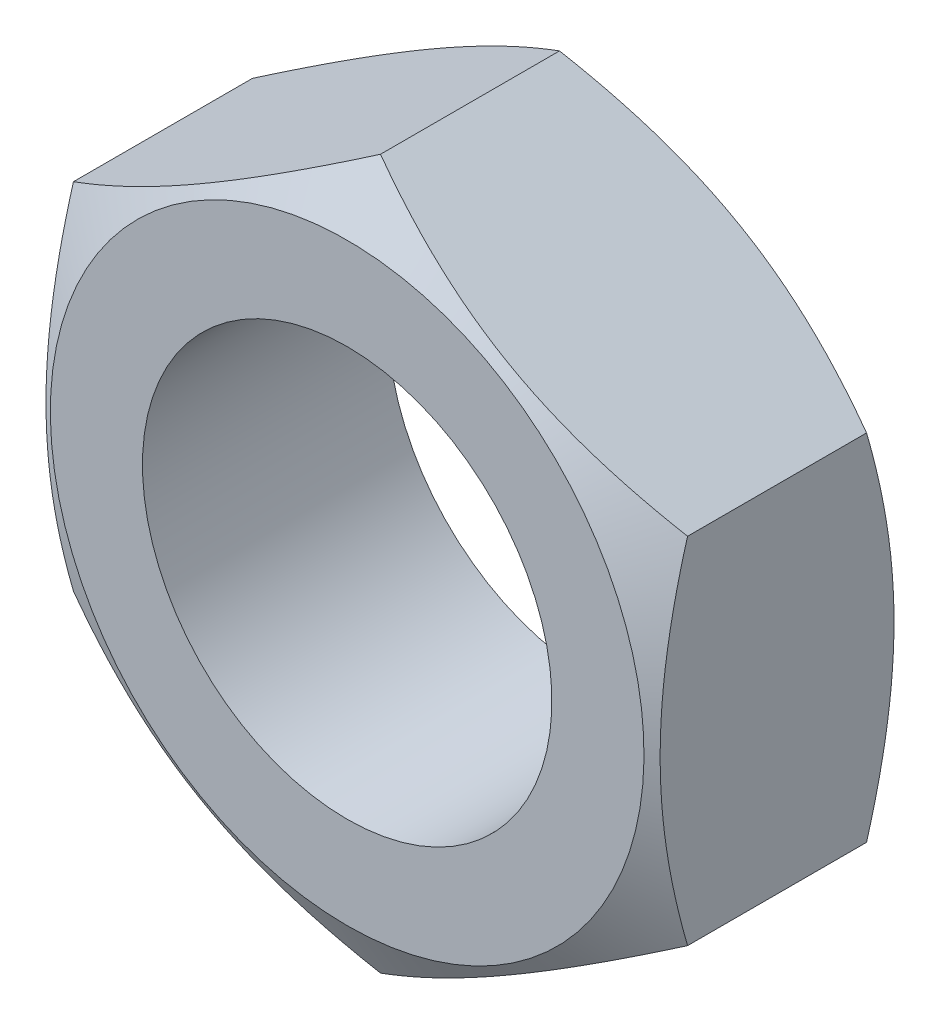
ISO-10303-21;
HEADER;
FILE_DESCRIPTION(('STEP AP214'),'2;1');
FILE_NAME('part.step','',(''),(''),'','','');
FILE_SCHEMA(('AUTOMOTIVE_DESIGN { 1 0 10303 214 1 1 1 1 }'));
ENDSEC;
DATA;
#1=APPLICATION_CONTEXT('core data for automotive mechanical design processes');
#2=APPLICATION_PROTOCOL_DEFINITION('international standard','automotive_design',2000,#1);
#3=PRODUCT_CONTEXT('',#1,'mechanical');
#4=PRODUCT('Part','Part','',(#3));
#5=PRODUCT_RELATED_PRODUCT_CATEGORY('part','',(#4));
#6=PRODUCT_DEFINITION_FORMATION('','',#4);
#7=PRODUCT_DEFINITION_CONTEXT('part definition',#1,'design');
#8=PRODUCT_DEFINITION('design','',#6,#7);
#9=PRODUCT_DEFINITION_SHAPE('','',#8);
#10=(LENGTH_UNIT() NAMED_UNIT(*) SI_UNIT(.MILLI.,.METRE.));
#11=(NAMED_UNIT(*) PLANE_ANGLE_UNIT() SI_UNIT($,.RADIAN.));
#12=(NAMED_UNIT(*) SI_UNIT($,.STERADIAN.) SOLID_ANGLE_UNIT());
#13=UNCERTAINTY_MEASURE_WITH_UNIT(LENGTH_MEASURE(1.E-05),#10,'distance_accuracy_value','');
#14=(GEOMETRIC_REPRESENTATION_CONTEXT(3) GLOBAL_UNCERTAINTY_ASSIGNED_CONTEXT((#13)) GLOBAL_UNIT_ASSIGNED_CONTEXT((#10,
#11,#12)) REPRESENTATION_CONTEXT('',''));
#15=CARTESIAN_POINT('',(0.,0.,0.));
#16=DIRECTION('',(0.,0.,1.));
#17=DIRECTION('',(1.,0.,0.));
#18=AXIS2_PLACEMENT_3D('',#15,#16,#17);
#19=CARTESIAN_POINT('',(-15.,-8.66025403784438,18.));
#20=DIRECTION('',(-1.,0.,0.));
#21=DIRECTION('',(0.,0.,1.));
#22=AXIS2_PLACEMENT_3D('',#19,#20,#21);
#23=PLANE('',#22);
#24=CARTESIAN_POINT('',(-15.,-23.4699725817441,4.2901236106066));
#25=CARTESIAN_POINT('',(-15.,-23.1415247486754,4.44990417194));
#26=CARTESIAN_POINT('',(-15.,-22.8126970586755,4.6089035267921));
#27=CARTESIAN_POINT('',(-15.,-22.1542027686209,4.92516329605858));
#28=CARTESIAN_POINT('',(-15.,-21.8245361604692,5.08242369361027));
#29=CARTESIAN_POINT('',(-15.,-20.8340741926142,5.55137178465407));
#30=CARTESIAN_POINT('',(-15.,-20.1719106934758,5.86018052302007));
#31=CARTESIAN_POINT('',(-15.,-18.8397161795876,6.46991088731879));
#32=CARTESIAN_POINT('',(-15.,-18.1696620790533,6.77078219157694));
#33=CARTESIAN_POINT('',(-15.,-16.8242973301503,7.36049108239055));
#34=CARTESIAN_POINT('',(-15.,-16.1489869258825,7.64932922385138));
#35=CARTESIAN_POINT('',(-15.,-14.7694563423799,8.22115365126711));
#36=CARTESIAN_POINT('',(-15.,-14.0650218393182,8.50362552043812));
#37=CARTESIAN_POINT('',(-15.,-12.6479834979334,9.04768994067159));
#38=CARTESIAN_POINT('',(-15.,-11.9353787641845,9.30928017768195));
#39=CARTESIAN_POINT('',(-15.,-10.5021570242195,9.80486153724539));
#40=CARTESIAN_POINT('',(-15.,-9.78155888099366,10.0389067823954));
#41=CARTESIAN_POINT('',(-15.,-8.3299601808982,10.4720397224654));
#42=CARTESIAN_POINT('',(-15.,-7.59896291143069,10.6711382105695));
#43=CARTESIAN_POINT('',(-15.,-6.49655522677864,10.9359278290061));
#44=CARTESIAN_POINT('',(-15.,-6.12914358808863,11.0183630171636));
#45=CARTESIAN_POINT('',(-15.,-5.39177201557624,11.170985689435));
#46=CARTESIAN_POINT('',(-15.,-5.02181213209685,11.2411734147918));
#47=CARTESIAN_POINT('',(-15.,-4.27958352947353,11.3680754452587));
#48=CARTESIAN_POINT('',(-15.,-3.90731484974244,11.4247899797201));
#49=CARTESIAN_POINT('',(-15.,-3.16084805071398,11.5236220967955));
#50=CARTESIAN_POINT('',(-15.,-2.78665001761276,11.5657403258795));
#51=CARTESIAN_POINT('',(-15.,-2.04182159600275,11.6340035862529));
#52=CARTESIAN_POINT('',(-15.,-1.6712101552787,11.6603540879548));
#53=CARTESIAN_POINT('',(-15.,-0.929205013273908,11.697348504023));
#54=CARTESIAN_POINT('',(-15.,-0.557811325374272,11.7079926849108));
#55=CARTESIAN_POINT('',(-15.,0.185094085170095,11.7133203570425));
#56=CARTESIAN_POINT('',(-15.,0.556605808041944,11.7080038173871));
#57=CARTESIAN_POINT('',(-15.,1.29906958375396,11.6815421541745));
#58=CARTESIAN_POINT('',(-15.,1.6700216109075,11.6603963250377));
#59=CARTESIAN_POINT('',(-15.,2.55529607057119,11.5914975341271));
#60=CARTESIAN_POINT('',(-15.,3.06907123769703,11.5365813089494));
#61=CARTESIAN_POINT('',(-15.,4.09294738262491,11.3993260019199));
#62=CARTESIAN_POINT('',(-15.,4.60304787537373,11.3169833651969));
#63=CARTESIAN_POINT('',(-15.,5.61903977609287,11.127804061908));
#64=CARTESIAN_POINT('',(-15.,6.1249277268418,11.0209490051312));
#65=CARTESIAN_POINT('',(-15.,7.13169797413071,10.7860166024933));
#66=CARTESIAN_POINT('',(-15.,7.63258033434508,10.6579395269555));
#67=CARTESIAN_POINT('',(-15.,8.64055583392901,10.3806091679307));
#68=CARTESIAN_POINT('',(-15.,9.1475348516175,10.2309439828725));
#69=CARTESIAN_POINT('',(-15.,10.1565015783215,9.91572688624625));
#70=CARTESIAN_POINT('',(-15.,10.6584892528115,9.75017486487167));
#71=CARTESIAN_POINT('',(-15.,11.6577149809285,9.40584964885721));
#72=CARTESIAN_POINT('',(-15.,12.1549544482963,9.22708053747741));
#73=CARTESIAN_POINT('',(-15.,13.1452841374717,8.85846579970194));
#74=CARTESIAN_POINT('',(-15.,13.6383744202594,8.66862033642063));
#75=CARTESIAN_POINT('',(-15.,14.8483575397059,8.18963171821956));
#76=CARTESIAN_POINT('',(-15.,15.56315957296,7.89521338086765));
#77=CARTESIAN_POINT('',(-15.,16.9862746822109,7.29104274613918));
#78=CARTESIAN_POINT('',(-15.,17.6945872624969,6.98128928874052));
#79=CARTESIAN_POINT('',(-15.,19.1060111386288,6.34968118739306));
#80=CARTESIAN_POINT('',(-15.,19.8091209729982,6.02782328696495));
#81=CARTESIAN_POINT('',(-15.,21.2108662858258,5.37458154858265));
#82=CARTESIAN_POINT('',(-15.,21.9095018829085,5.04319796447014));
#83=CARTESIAN_POINT('',(-15.,23.3039583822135,4.37235226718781));
#84=CARTESIAN_POINT('',(-15.,23.9997746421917,4.03288052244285));
#85=CARTESIAN_POINT('',(-15.,25.3883291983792,3.34769944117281));
#86=CARTESIAN_POINT('',(-15.,26.081067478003,3.00199007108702));
#87=CARTESIAN_POINT('',(-15.,27.4638560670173,2.30550379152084));
#88=CARTESIAN_POINT('',(-15.,28.1539067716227,1.95472766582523));
#89=CARTESIAN_POINT('',(-15.,29.5318258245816,1.24892319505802));
#90=CARTESIAN_POINT('',(-15.,30.2196941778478,0.893894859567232));
#91=CARTESIAN_POINT('',(-15.,32.1564022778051,-0.112035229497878));
#92=CARTESIAN_POINT('',(-15.,33.4031142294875,-0.767033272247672));
#93=CARTESIAN_POINT('',(-15.,35.8919889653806,-2.0857235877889));
#94=CARTESIAN_POINT('',(-15.,37.1341515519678,-2.74941623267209));
#95=CARTESIAN_POINT('',(-15.,39.6114638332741,-4.0815417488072));
#96=CARTESIAN_POINT('',(-15.,40.8466234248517,-4.74995622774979));
#97=CARTESIAN_POINT('',(-15.,42.6972399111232,-5.75638590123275));
#98=CARTESIAN_POINT('',(-15.,43.3137394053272,-6.09248676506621));
#99=CARTESIAN_POINT('',(-15.,44.5461141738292,-6.76582888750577));
#100=CARTESIAN_POINT('',(-15.,45.1619894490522,-7.10307014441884));
#101=CARTESIAN_POINT('',(-15.,45.777588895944,-7.44081428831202));
#102=B_SPLINE_CURVE_WITH_KNOTS('',3,(#24,#25,#26,#27,#28,#29,#30,#31,#32,#33,#34,#35,#36,#37,
#38,#39,#40,#41,#42,#43,#44,#45,#46,#47,#48,#49,#50,#51,#52,#53,#54,#55,#56,#57,#58,#59,#60,#61,
#62,#63,#64,#65,#66,#67,#68,#69,#70,#71,#72,#73,#74,#75,#76,#77,#78,#79,#80,#81,#82,#83,#84,#85,
#86,#87,#88,#89,#90,#91,#92,#93,#94,#95,#96,#97,#98,#99,#100,#101),.UNSPECIFIED.,.F.,.F.,(4,2,2,
2,2,2,2,2,2,2,2,2,2,2,2,2,2,2,2,2,2,2,2,2,2,2,2,2,2,2,2,2,2,2,2,2,2,2,4),(0.,1.09574908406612,
2.19150878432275,4.38334194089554,6.58676146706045,8.79007927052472,11.0667025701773,
13.3435778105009,15.615901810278,17.887522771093,19.0169896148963,20.1464342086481,
21.2758595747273,22.4052349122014,23.5195532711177,24.6338527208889,25.7481543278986,
26.8625056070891,28.4117584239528,29.961212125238,31.5118321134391,33.0624323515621,
34.6479488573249,36.233476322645,37.8185159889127,39.4035323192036,41.7224664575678,
44.041576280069,46.3613145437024,48.680991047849,51.0035835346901,53.3261885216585,
55.6484379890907,57.9706822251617,62.1955342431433,66.4205676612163,70.6338128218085,
72.7403063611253,74.8467967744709),.UNSPECIFIED.);
#103=CARTESIAN_POINT('',(-15.,8.66025403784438,10.3715789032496));
#104=VERTEX_POINT('',#103);
#105=CARTESIAN_POINT('',(-15.,-8.66025403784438,10.3715789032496));
#106=VERTEX_POINT('',#105);
#107=EDGE_CURVE('E74',#104,#106,#102,.F.);
#108=ORIENTED_EDGE('',*,*,#107,.F.);
#109=DIRECTION('',(0.,0.,-1.));
#110=VECTOR('',#109,1.);
#111=CARTESIAN_POINT('',(-15.,8.66025403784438,18.));
#112=LINE('',#111,#110);
#113=CARTESIAN_POINT('',(-15.,8.66025403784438,1.62842109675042));
#114=VERTEX_POINT('',#113);
#115=EDGE_CURVE('E43',#104,#114,#112,.T.);
#116=ORIENTED_EDGE('',*,*,#115,.T.);
#117=CARTESIAN_POINT('',(-15.,-23.4699725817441,7.70987638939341));
#118=CARTESIAN_POINT('',(-15.,-23.1415247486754,7.55009582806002));
#119=CARTESIAN_POINT('',(-15.,-22.8126970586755,7.39109647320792));
#120=CARTESIAN_POINT('',(-15.,-22.1542027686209,7.07483670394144));
#121=CARTESIAN_POINT('',(-15.,-21.8245361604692,6.91757630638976));
#122=CARTESIAN_POINT('',(-15.,-20.8340741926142,6.44862821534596));
#123=CARTESIAN_POINT('',(-15.,-20.1719106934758,6.13981947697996));
#124=CARTESIAN_POINT('',(-15.,-18.8397161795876,5.53008911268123));
#125=CARTESIAN_POINT('',(-15.,-18.1696620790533,5.22921780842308));
#126=CARTESIAN_POINT('',(-15.,-16.8242973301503,4.63950891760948));
#127=CARTESIAN_POINT('',(-15.,-16.1489869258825,4.35067077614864));
#128=CARTESIAN_POINT('',(-15.,-14.7694563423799,3.77884634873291));
#129=CARTESIAN_POINT('',(-15.,-14.0650218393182,3.49637447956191));
#130=CARTESIAN_POINT('',(-15.,-12.6479834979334,2.95231005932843));
#131=CARTESIAN_POINT('',(-15.,-11.9353787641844,2.69071982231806));
#132=CARTESIAN_POINT('',(-15.,-10.5021570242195,2.19513846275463));
#133=CARTESIAN_POINT('',(-15.,-9.78155888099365,1.96109321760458));
#134=CARTESIAN_POINT('',(-15.,-8.32996018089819,1.52796027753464));
#135=CARTESIAN_POINT('',(-15.,-7.59896291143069,1.32886178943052));
#136=CARTESIAN_POINT('',(-15.,-6.49655522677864,1.06407217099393));
#137=CARTESIAN_POINT('',(-15.,-6.12914358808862,0.981636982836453));
#138=CARTESIAN_POINT('',(-15.,-5.39177201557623,0.829014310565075));
#139=CARTESIAN_POINT('',(-15.,-5.02181213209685,0.758826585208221));
#140=CARTESIAN_POINT('',(-15.,-4.27958352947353,0.631924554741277));
#141=CARTESIAN_POINT('',(-15.,-3.90731484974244,0.575210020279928));
#142=CARTESIAN_POINT('',(-15.,-3.16084805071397,0.4763779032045));
#143=CARTESIAN_POINT('',(-15.,-2.78665001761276,0.434259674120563));
#144=CARTESIAN_POINT('',(-15.,-2.04182159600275,0.365996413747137));
#145=CARTESIAN_POINT('',(-15.,-1.6712101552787,0.339645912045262));
#146=CARTESIAN_POINT('',(-15.,-0.929205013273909,0.302651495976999));
#147=CARTESIAN_POINT('',(-15.,-0.557811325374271,0.292007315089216));
#148=CARTESIAN_POINT('',(-15.,0.185094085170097,0.286679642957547));
#149=CARTESIAN_POINT('',(-15.,0.556605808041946,0.291996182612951));
#150=CARTESIAN_POINT('',(-15.,1.29906958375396,0.318457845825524));
#151=CARTESIAN_POINT('',(-15.,1.6700216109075,0.339603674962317));
#152=CARTESIAN_POINT('',(-15.,2.55529607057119,0.408502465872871));
#153=CARTESIAN_POINT('',(-15.,3.06907123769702,0.463418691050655));
#154=CARTESIAN_POINT('',(-15.,4.0929473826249,0.60067399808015));
#155=CARTESIAN_POINT('',(-15.,4.60304787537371,0.683016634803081));
#156=CARTESIAN_POINT('',(-15.,5.61903977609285,0.872195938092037));
#157=CARTESIAN_POINT('',(-15.,6.12492772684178,0.979050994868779));
#158=CARTESIAN_POINT('',(-15.,7.13169797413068,1.21398339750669));
#159=CARTESIAN_POINT('',(-15.,7.63258033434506,1.34206047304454));
#160=CARTESIAN_POINT('',(-15.,8.64055583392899,1.6193908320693));
#161=CARTESIAN_POINT('',(-15.,9.14753485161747,1.76905601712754));
#162=CARTESIAN_POINT('',(-15.,10.1565015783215,2.08427311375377));
#163=CARTESIAN_POINT('',(-15.,10.6584892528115,2.24982513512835));
#164=CARTESIAN_POINT('',(-15.,11.6577149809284,2.5941503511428));
#165=CARTESIAN_POINT('',(-15.,12.1549544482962,2.77291946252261));
#166=CARTESIAN_POINT('',(-15.,13.1452841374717,3.14153420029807));
#167=CARTESIAN_POINT('',(-15.,13.6383744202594,3.33137966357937));
#168=CARTESIAN_POINT('',(-15.,14.8483575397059,3.81036828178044));
#169=CARTESIAN_POINT('',(-15.,15.56315957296,4.10478661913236));
#170=CARTESIAN_POINT('',(-15.,16.9862746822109,4.70895725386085));
#171=CARTESIAN_POINT('',(-15.,17.6945872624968,5.0187107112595));
#172=CARTESIAN_POINT('',(-15.,19.1060111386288,5.65031881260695));
#173=CARTESIAN_POINT('',(-15.,19.8091209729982,5.97217671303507));
#174=CARTESIAN_POINT('',(-15.,21.2108662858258,6.62541845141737));
#175=CARTESIAN_POINT('',(-15.,21.9095018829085,6.95680203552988));
#176=CARTESIAN_POINT('',(-15.,23.3039583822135,7.62764773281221));
#177=CARTESIAN_POINT('',(-15.,23.9997746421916,7.96711947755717));
#178=CARTESIAN_POINT('',(-15.,25.3883291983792,8.65230055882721));
#179=CARTESIAN_POINT('',(-15.,26.081067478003,8.998009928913));
#180=CARTESIAN_POINT('',(-15.,27.4638560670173,9.69449620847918));
#181=CARTESIAN_POINT('',(-15.,28.1539067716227,10.0452723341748));
#182=CARTESIAN_POINT('',(-15.,29.5318258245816,10.751076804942));
#183=CARTESIAN_POINT('',(-15.,30.2196941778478,11.1061051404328));
#184=CARTESIAN_POINT('',(-15.,32.1564022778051,12.1120352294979));
#185=CARTESIAN_POINT('',(-15.,33.4031142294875,12.7670332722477));
#186=CARTESIAN_POINT('',(-15.,35.8919889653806,14.0857235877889));
#187=CARTESIAN_POINT('',(-15.,37.1341515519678,14.7494162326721));
#188=CARTESIAN_POINT('',(-15.,39.6114638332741,16.0815417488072));
#189=CARTESIAN_POINT('',(-15.,40.8466234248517,16.7499562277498));
#190=CARTESIAN_POINT('',(-15.,42.6972399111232,17.7563859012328));
#191=CARTESIAN_POINT('',(-15.,43.3137394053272,18.0924867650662));
#192=CARTESIAN_POINT('',(-15.,44.5461141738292,18.7658288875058));
#193=CARTESIAN_POINT('',(-15.,45.1619894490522,19.1030701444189));
#194=CARTESIAN_POINT('',(-15.,45.777588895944,19.440814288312));
#195=B_SPLINE_CURVE_WITH_KNOTS('',3,(#117,#118,#119,#120,#121,#122,#123,#124,#125,#126,#127,
#128,#129,#130,#131,#132,#133,#134,#135,#136,#137,#138,#139,#140,#141,#142,#143,#144,#145,#146,
#147,#148,#149,#150,#151,#152,#153,#154,#155,#156,#157,#158,#159,#160,#161,#162,#163,#164,#165,
#166,#167,#168,#169,#170,#171,#172,#173,#174,#175,#176,#177,#178,#179,#180,#181,#182,#183,#184,
#185,#186,#187,#188,#189,#190,#191,#192,#193,#194),.UNSPECIFIED.,.F.,.F.,(4,2,2,2,2,2,2,2,2,2,2,
2,2,2,2,2,2,2,2,2,2,2,2,2,2,2,2,2,2,2,2,2,2,2,2,2,2,2,4),(0.,1.09574908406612,2.19150878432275,
4.38334194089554,6.58676146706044,8.79007927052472,11.0667025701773,13.3435778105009,
15.6159018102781,17.887522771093,19.0169896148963,20.1464342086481,21.2758595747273,
22.4052349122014,23.5195532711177,24.6338527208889,25.7481543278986,26.8625056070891,
28.4117584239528,29.961212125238,31.5118321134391,33.0624323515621,34.6479488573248,
36.233476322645,37.8185159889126,39.4035323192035,41.7224664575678,44.041576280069,
46.3613145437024,48.6809910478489,51.0035835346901,53.3261885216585,55.6484379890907,
57.9706822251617,62.1955342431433,66.4205676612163,70.6338128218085,72.7403063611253,
74.8467967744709),.UNSPECIFIED.);
#196=CARTESIAN_POINT('',(-15.,-8.66025403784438,1.62842109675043));
#197=VERTEX_POINT('',#196);
#198=EDGE_CURVE('E92',#197,#114,#195,.T.);
#199=ORIENTED_EDGE('',*,*,#198,.F.);
#200=DIRECTION('',(0.,0.,-1.));
#201=VECTOR('',#200,1.);
#202=CARTESIAN_POINT('',(-15.,-8.66025403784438,18.));
#203=LINE('',#202,#201);
#204=EDGE_CURVE('E29',#106,#197,#203,.T.);
#205=ORIENTED_EDGE('',*,*,#204,.F.);
#206=EDGE_LOOP('',(#108,#116,#199,#205));
#207=FACE_BOUND('',#206,.T.);
#208=ADVANCED_FACE('F14',(#207),#23,.T.);
#209=CARTESIAN_POINT('',(-15.,-8.66025403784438,18.));
#210=DIRECTION('',(0.5,0.86602540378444,0.));
#211=DIRECTION('',(-0.86602540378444,0.5,0.));
#212=AXIS2_PLACEMENT_3D('',#209,#210,#211);
#213=PLANE('',#212);
#214=DIRECTION('',(0.,0.,-1.));
#215=VECTOR('',#214,1.);
#216=CARTESIAN_POINT('',(0.,-17.3205080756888,18.));
#217=LINE('',#216,#215);
#218=CARTESIAN_POINT('',(0.,-17.3205080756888,10.3715789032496));
#219=VERTEX_POINT('',#218);
#220=CARTESIAN_POINT('',(0.,-17.3205080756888,1.62842109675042));
#221=VERTEX_POINT('',#220);
#222=EDGE_CURVE('E99',#219,#221,#217,.T.);
#223=ORIENTED_EDGE('',*,*,#222,.F.);
#224=CARTESIAN_POINT('',(0.000200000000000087,-17.3206235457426,10.3715122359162));
#225=CARTESIAN_POINT('',(-0.329494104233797,-17.130274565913,10.4814030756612));
#226=CARTESIAN_POINT('',(-0.660474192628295,-16.939183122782,10.5863072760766));
#227=CARTESIAN_POINT('',(-1.32508844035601,-16.5554679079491,10.7847562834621));
#228=CARTESIAN_POINT('',(-1.6587234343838,-16.3628436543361,10.8782973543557));
#229=CARTESIAN_POINT('',(-2.32929228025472,-15.9756905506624,11.0527627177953));
#230=CARTESIAN_POINT('',(-2.66623200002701,-15.7811583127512,11.133657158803));
#231=CARTESIAN_POINT('',(-3.34245276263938,-15.3907420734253,11.2810922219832));
#232=CARTESIAN_POINT('',(-3.68173367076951,-15.1948581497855,11.3476336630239));
#233=CARTESIAN_POINT('',(-4.35394314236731,-14.8067578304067,11.4635324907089));
#234=CARTESIAN_POINT('',(-4.68682180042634,-14.6145702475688,11.5132734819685));
#235=CARTESIAN_POINT('',(-5.3541044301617,-14.2293144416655,11.5966781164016));
#236=CARTESIAN_POINT('',(-5.68850843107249,-14.0362462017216,11.6303414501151));
#237=CARTESIAN_POINT('',(-6.35787818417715,-13.6497853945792,11.6807407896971));
#238=CARTESIAN_POINT('',(-6.69284279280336,-13.4563934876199,11.6974969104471));
#239=CARTESIAN_POINT('',(-7.36308121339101,-13.0694311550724,11.7137214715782));
#240=CARTESIAN_POINT('',(-7.69835501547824,-12.8758607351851,11.7131904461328));
#241=CARTESIAN_POINT('',(-8.3251468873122,-12.5139822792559,11.696048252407));
#242=CARTESIAN_POINT('',(-8.61670962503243,-12.3456484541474,11.6815280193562));
#243=CARTESIAN_POINT('',(-9.19916443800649,-12.0093680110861,11.6396877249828));
#244=CARTESIAN_POINT('',(-9.49005646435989,-11.8414214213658,11.6123667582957));
#245=CARTESIAN_POINT('',(-10.0710118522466,-11.5060066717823,11.5454013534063));
#246=CARTESIAN_POINT('',(-10.3610743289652,-11.338539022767,11.5057467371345));
#247=CARTESIAN_POINT('',(-10.939839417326,-11.0043888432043,11.4148097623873));
#248=CARTESIAN_POINT('',(-11.2285419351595,-10.8377063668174,11.3635266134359));
#249=CARTESIAN_POINT('',(-12.1049144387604,-10.3317324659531,11.1909380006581));
#250=CARTESIAN_POINT('',(-12.6900465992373,-9.99390625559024,11.0524236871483));
#251=CARTESIAN_POINT('',(-13.8515859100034,-9.32329122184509,10.73805289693));
#252=CARTESIAN_POINT('',(-14.4280079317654,-8.99049381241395,10.5622702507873));
#253=CARTESIAN_POINT('',(-15.0002,-8.66013856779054,10.3715122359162));
#254=B_SPLINE_CURVE_WITH_KNOTS('',3,(#224,#225,#226,#227,#228,#229,#230,#231,#232,#233,#234,
#235,#236,#237,#238,#239,#240,#241,#242,#243,#244,#245,#246,#247,#248,#249,#250,#251,#252,#253),
.UNSPECIFIED.,.F.,.F.,(4,2,2,2,2,2,2,2,2,2,2,2,2,2,4),(0.,1.18875411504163,2.37789802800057,
3.56980778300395,4.76164951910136,5.92407379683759,7.08652044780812,8.24758247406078,
9.40860862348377,10.4193068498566,11.4300765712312,12.4416826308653,13.4533574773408,
15.5211962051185,17.5849760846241),.UNSPECIFIED.);
#255=EDGE_CURVE('E80',#219,#106,#254,.T.);
#256=ORIENTED_EDGE('',*,*,#255,.T.);
#257=ORIENTED_EDGE('',*,*,#204,.T.);
#258=CARTESIAN_POINT('',(-15.0002,-8.66013856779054,1.62848776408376));
#259=CARTESIAN_POINT('',(-14.6705058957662,-8.85048754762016,1.51859692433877));
#260=CARTESIAN_POINT('',(-14.3395258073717,-9.04157899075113,1.41369272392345));
#261=CARTESIAN_POINT('',(-13.674911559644,-9.42529420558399,1.21524371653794));
#262=CARTESIAN_POINT('',(-13.3412765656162,-9.61791845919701,1.12170264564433));
#263=CARTESIAN_POINT('',(-12.6707077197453,-10.0050715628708,0.947237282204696));
#264=CARTESIAN_POINT('',(-12.333767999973,-10.199603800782,0.866342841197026));
#265=CARTESIAN_POINT('',(-11.6575472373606,-10.5900200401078,0.718907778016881));
#266=CARTESIAN_POINT('',(-11.3182663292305,-10.7859039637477,0.652366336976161));
#267=CARTESIAN_POINT('',(-10.6460568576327,-11.1740042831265,0.536467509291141));
#268=CARTESIAN_POINT('',(-10.3131781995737,-11.3661918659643,0.4867265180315));
#269=CARTESIAN_POINT('',(-9.6458955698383,-11.7514476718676,0.403321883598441));
#270=CARTESIAN_POINT('',(-9.3114915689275,-11.9445159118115,0.369658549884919));
#271=CARTESIAN_POINT('',(-8.64212181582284,-12.3309767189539,0.319259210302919));
#272=CARTESIAN_POINT('',(-8.30715720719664,-12.5243686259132,0.302503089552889));
#273=CARTESIAN_POINT('',(-7.63691878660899,-12.9113309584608,0.286278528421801));
#274=CARTESIAN_POINT('',(-7.30164498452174,-13.104901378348,0.286809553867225));
#275=CARTESIAN_POINT('',(-6.67485311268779,-13.4667798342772,0.303951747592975));
#276=CARTESIAN_POINT('',(-6.38329037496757,-13.6351136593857,0.318471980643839));
#277=CARTESIAN_POINT('',(-5.80083556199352,-13.971394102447,0.360312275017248));
#278=CARTESIAN_POINT('',(-5.50994353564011,-14.1393406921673,0.387633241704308));
#279=CARTESIAN_POINT('',(-4.92898814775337,-14.4747554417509,0.454598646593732));
#280=CARTESIAN_POINT('',(-4.63892567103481,-14.6422230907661,0.49425326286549));
#281=CARTESIAN_POINT('',(-4.06016058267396,-14.9763732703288,0.585190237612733));
#282=CARTESIAN_POINT('',(-3.77145806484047,-15.1430557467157,0.636473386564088));
#283=CARTESIAN_POINT('',(-2.89508556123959,-15.6490296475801,0.809061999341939));
#284=CARTESIAN_POINT('',(-2.30995340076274,-15.9868558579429,0.947576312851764));
#285=CARTESIAN_POINT('',(-1.14841408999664,-16.657470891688,1.26194710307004));
#286=CARTESIAN_POINT('',(-0.571992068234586,-16.9902683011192,1.4377297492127));
#287=CARTESIAN_POINT('',(0.00019999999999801,-17.3206235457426,1.62848776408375));
#288=B_SPLINE_CURVE_WITH_KNOTS('',3,(#258,#259,#260,#261,#262,#263,#264,#265,#266,#267,#268,
#269,#270,#271,#272,#273,#274,#275,#276,#277,#278,#279,#280,#281,#282,#283,#284,#285,#286,#287),
.UNSPECIFIED.,.F.,.F.,(4,2,2,2,2,2,2,2,2,2,2,2,2,2,4),(0.,1.18875411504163,2.37789802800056,
3.56980778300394,4.76164951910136,5.92407379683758,7.08652044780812,8.24758247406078,
9.40860862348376,10.4193068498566,11.4300765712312,12.4416826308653,13.4533574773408,
15.5211962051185,17.5849760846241),.UNSPECIFIED.);
#289=EDGE_CURVE('E166',#197,#221,#288,.T.);
#290=ORIENTED_EDGE('',*,*,#289,.T.);
#291=EDGE_LOOP('',(#223,#256,#257,#290));
#292=FACE_BOUND('',#291,.T.);
#293=ADVANCED_FACE('F16',(#292),#213,.F.);
#294=CARTESIAN_POINT('',(15.,-8.66025403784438,18.));
#295=DIRECTION('',(0.5,-0.866025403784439,0.));
#296=DIRECTION('',(0.86602540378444,0.5,0.));
#297=AXIS2_PLACEMENT_3D('',#294,#295,#296);
#298=PLANE('',#297);
#299=CARTESIAN_POINT('',(-0.000199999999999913,-17.3206235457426,10.3715122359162));
#300=CARTESIAN_POINT('',(0.329494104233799,-17.130274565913,10.4814030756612));
#301=CARTESIAN_POINT('',(0.660474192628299,-16.939183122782,10.5863072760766));
#302=CARTESIAN_POINT('',(1.32508844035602,-16.5554679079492,10.7847562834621));
#303=CARTESIAN_POINT('',(1.6587234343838,-16.3628436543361,10.8782973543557));
#304=CARTESIAN_POINT('',(2.32929228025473,-15.9756905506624,11.0527627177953));
#305=CARTESIAN_POINT('',(2.66623200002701,-15.7811583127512,11.133657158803));
#306=CARTESIAN_POINT('',(3.34245276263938,-15.3907420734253,11.2810922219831));
#307=CARTESIAN_POINT('',(3.68173367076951,-15.1948581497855,11.3476336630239));
#308=CARTESIAN_POINT('',(4.35394314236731,-14.8067578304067,11.4635324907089));
#309=CARTESIAN_POINT('',(4.68682180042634,-14.6145702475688,11.5132734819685));
#310=CARTESIAN_POINT('',(5.3541044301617,-14.2293144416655,11.5966781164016));
#311=CARTESIAN_POINT('',(5.68850843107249,-14.0362462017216,11.6303414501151));
#312=CARTESIAN_POINT('',(6.35787818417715,-13.6497853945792,11.6807407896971));
#313=CARTESIAN_POINT('',(6.69284279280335,-13.4563934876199,11.6974969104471));
#314=CARTESIAN_POINT('',(7.363081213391,-13.0694311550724,11.7137214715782));
#315=CARTESIAN_POINT('',(7.69835501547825,-12.8758607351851,11.7131904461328));
#316=CARTESIAN_POINT('',(8.3251468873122,-12.5139822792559,11.696048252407));
#317=CARTESIAN_POINT('',(8.61670962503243,-12.3456484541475,11.6815280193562));
#318=CARTESIAN_POINT('',(9.19916443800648,-12.0093680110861,11.6396877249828));
#319=CARTESIAN_POINT('',(9.49005646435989,-11.8414214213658,11.6123667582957));
#320=CARTESIAN_POINT('',(10.0710118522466,-11.5060066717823,11.5454013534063));
#321=CARTESIAN_POINT('',(10.3610743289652,-11.338539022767,11.5057467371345));
#322=CARTESIAN_POINT('',(10.939839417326,-11.0043888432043,11.4148097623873));
#323=CARTESIAN_POINT('',(11.2285419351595,-10.8377063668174,11.3635266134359));
#324=CARTESIAN_POINT('',(12.1049144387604,-10.3317324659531,11.1909380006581));
#325=CARTESIAN_POINT('',(12.6900465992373,-9.99390625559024,11.0524236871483));
#326=CARTESIAN_POINT('',(13.8515859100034,-9.32329122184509,10.73805289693));
#327=CARTESIAN_POINT('',(14.4280079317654,-8.99049381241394,10.5622702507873));
#328=CARTESIAN_POINT('',(15.0002,-8.66013856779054,10.3715122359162));
#329=B_SPLINE_CURVE_WITH_KNOTS('',3,(#299,#300,#301,#302,#303,#304,#305,#306,#307,#308,#309,
#310,#311,#312,#313,#314,#315,#316,#317,#318,#319,#320,#321,#322,#323,#324,#325,#326,#327,#328),
.UNSPECIFIED.,.F.,.F.,(4,2,2,2,2,2,2,2,2,2,2,2,2,2,4),(0.,1.18875411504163,2.37789802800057,
3.56980778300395,4.76164951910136,5.92407379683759,7.08652044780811,8.24758247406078,
9.40860862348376,10.4193068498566,11.4300765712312,12.4416826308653,13.4533574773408,
15.5211962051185,17.5849760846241),.UNSPECIFIED.);
#330=CARTESIAN_POINT('',(15.,-8.66025403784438,10.3715789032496));
#331=VERTEX_POINT('',#330);
#332=EDGE_CURVE('E138',#219,#331,#329,.T.);
#333=ORIENTED_EDGE('',*,*,#332,.F.);
#334=ORIENTED_EDGE('',*,*,#222,.T.);
#335=CARTESIAN_POINT('',(15.0002,-8.66013856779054,1.62848776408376));
#336=CARTESIAN_POINT('',(14.6705058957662,-8.85048754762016,1.51859692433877));
#337=CARTESIAN_POINT('',(14.3395258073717,-9.04157899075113,1.41369272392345));
#338=CARTESIAN_POINT('',(13.674911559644,-9.42529420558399,1.21524371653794));
#339=CARTESIAN_POINT('',(13.3412765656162,-9.61791845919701,1.12170264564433));
#340=CARTESIAN_POINT('',(12.6707077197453,-10.0050715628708,0.947237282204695));
#341=CARTESIAN_POINT('',(12.333767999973,-10.199603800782,0.866342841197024));
#342=CARTESIAN_POINT('',(11.6575472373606,-10.5900200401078,0.718907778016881));
#343=CARTESIAN_POINT('',(11.3182663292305,-10.7859039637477,0.652366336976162));
#344=CARTESIAN_POINT('',(10.6460568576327,-11.1740042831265,0.536467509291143));
#345=CARTESIAN_POINT('',(10.3131781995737,-11.3661918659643,0.486726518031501));
#346=CARTESIAN_POINT('',(9.6458955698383,-11.7514476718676,0.403321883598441));
#347=CARTESIAN_POINT('',(9.3114915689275,-11.9445159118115,0.369658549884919));
#348=CARTESIAN_POINT('',(8.64212181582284,-12.3309767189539,0.31925921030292));
#349=CARTESIAN_POINT('',(8.30715720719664,-12.5243686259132,0.30250308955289));
#350=CARTESIAN_POINT('',(7.63691878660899,-12.9113309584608,0.286278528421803));
#351=CARTESIAN_POINT('',(7.30164498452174,-13.104901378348,0.286809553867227));
#352=CARTESIAN_POINT('',(6.67485311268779,-13.4667798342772,0.303951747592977));
#353=CARTESIAN_POINT('',(6.38329037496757,-13.6351136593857,0.31847198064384));
#354=CARTESIAN_POINT('',(5.80083556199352,-13.9713941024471,0.360312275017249));
#355=CARTESIAN_POINT('',(5.50994353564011,-14.1393406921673,0.387633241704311));
#356=CARTESIAN_POINT('',(4.92898814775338,-14.4747554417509,0.454598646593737));
#357=CARTESIAN_POINT('',(4.63892567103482,-14.6422230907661,0.494253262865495));
#358=CARTESIAN_POINT('',(4.06016058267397,-14.9763732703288,0.585190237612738));
#359=CARTESIAN_POINT('',(3.77145806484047,-15.1430557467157,0.636473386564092));
#360=CARTESIAN_POINT('',(2.89508556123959,-15.6490296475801,0.809061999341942));
#361=CARTESIAN_POINT('',(2.30995340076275,-15.9868558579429,0.947576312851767));
#362=CARTESIAN_POINT('',(1.14841408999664,-16.657470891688,1.26194710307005));
#363=CARTESIAN_POINT('',(0.57199206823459,-16.9902683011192,1.4377297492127));
#364=CARTESIAN_POINT('',(-0.000199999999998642,-17.3206235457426,1.62848776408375));
#365=B_SPLINE_CURVE_WITH_KNOTS('',3,(#335,#336,#337,#338,#339,#340,#341,#342,#343,#344,#345,
#346,#347,#348,#349,#350,#351,#352,#353,#354,#355,#356,#357,#358,#359,#360,#361,#362,#363,#364),
.UNSPECIFIED.,.F.,.F.,(4,2,2,2,2,2,2,2,2,2,2,2,2,2,4),(0.,1.18875411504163,2.37789802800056,
3.56980778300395,4.76164951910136,5.92407379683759,7.08652044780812,8.24758247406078,
9.40860862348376,10.4193068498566,11.4300765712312,12.4416826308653,13.4533574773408,
15.5211962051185,17.5849760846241),.UNSPECIFIED.);
#366=CARTESIAN_POINT('',(15.,-8.66025403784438,1.62842109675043));
#367=VERTEX_POINT('',#366);
#368=EDGE_CURVE('E173',#367,#221,#365,.T.);
#369=ORIENTED_EDGE('',*,*,#368,.F.);
#370=DIRECTION('',(0.,0.,-1.));
#371=VECTOR('',#370,1.);
#372=CARTESIAN_POINT('',(15.,-8.66025403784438,18.));
#373=LINE('',#372,#371);
#374=EDGE_CURVE('E97',#331,#367,#373,.T.);
#375=ORIENTED_EDGE('',*,*,#374,.F.);
#376=EDGE_LOOP('',(#333,#334,#369,#375));
#377=FACE_BOUND('',#376,.T.);
#378=ADVANCED_FACE('F186',(#377),#298,.T.);
#379=CARTESIAN_POINT('',(15.,-8.66025403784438,18.));
#380=DIRECTION('',(-1.,0.,0.));
#381=DIRECTION('',(0.,0.,1.));
#382=AXIS2_PLACEMENT_3D('',#379,#380,#381);
#383=PLANE('',#382);
#384=DIRECTION('',(0.,0.,-1.));
#385=VECTOR('',#384,1.);
#386=CARTESIAN_POINT('',(15.,8.66025403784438,18.));
#387=LINE('',#386,#385);
#388=CARTESIAN_POINT('',(15.,8.66025403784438,10.3715789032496));
#389=VERTEX_POINT('',#388);
#390=CARTESIAN_POINT('',(15.,8.66025403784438,1.62842109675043));
#391=VERTEX_POINT('',#390);
#392=EDGE_CURVE('E89',#389,#391,#387,.T.);
#393=ORIENTED_EDGE('',*,*,#392,.F.);
#394=CARTESIAN_POINT('',(15.,-23.4699725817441,4.2901236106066));
#395=CARTESIAN_POINT('',(15.,-23.1415247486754,4.44990417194));
#396=CARTESIAN_POINT('',(15.,-22.8126970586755,4.6089035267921));
#397=CARTESIAN_POINT('',(15.,-22.1542027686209,4.92516329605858));
#398=CARTESIAN_POINT('',(15.,-21.8245361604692,5.08242369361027));
#399=CARTESIAN_POINT('',(15.,-20.8340741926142,5.55137178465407));
#400=CARTESIAN_POINT('',(15.,-20.1719106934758,5.86018052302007));
#401=CARTESIAN_POINT('',(15.,-18.8397161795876,6.46991088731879));
#402=CARTESIAN_POINT('',(15.,-18.1696620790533,6.77078219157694));
#403=CARTESIAN_POINT('',(15.,-16.8242973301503,7.36049108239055));
#404=CARTESIAN_POINT('',(15.,-16.1489869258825,7.64932922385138));
#405=CARTESIAN_POINT('',(15.,-14.7694563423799,8.22115365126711));
#406=CARTESIAN_POINT('',(15.,-14.0650218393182,8.50362552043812));
#407=CARTESIAN_POINT('',(15.,-12.6479834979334,9.04768994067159));
#408=CARTESIAN_POINT('',(15.,-11.9353787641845,9.30928017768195));
#409=CARTESIAN_POINT('',(15.,-10.5021570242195,9.80486153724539));
#410=CARTESIAN_POINT('',(15.,-9.78155888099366,10.0389067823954));
#411=CARTESIAN_POINT('',(15.,-8.3299601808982,10.4720397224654));
#412=CARTESIAN_POINT('',(15.,-7.59896291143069,10.6711382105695));
#413=CARTESIAN_POINT('',(15.,-6.49655522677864,10.9359278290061));
#414=CARTESIAN_POINT('',(15.,-6.12914358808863,11.0183630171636));
#415=CARTESIAN_POINT('',(15.,-5.39177201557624,11.170985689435));
#416=CARTESIAN_POINT('',(15.,-5.02181213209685,11.2411734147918));
#417=CARTESIAN_POINT('',(15.,-4.27958352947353,11.3680754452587));
#418=CARTESIAN_POINT('',(15.,-3.90731484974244,11.4247899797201));
#419=CARTESIAN_POINT('',(15.,-3.16084805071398,11.5236220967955));
#420=CARTESIAN_POINT('',(15.,-2.78665001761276,11.5657403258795));
#421=CARTESIAN_POINT('',(15.,-2.04182159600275,11.6340035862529));
#422=CARTESIAN_POINT('',(15.,-1.6712101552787,11.6603540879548));
#423=CARTESIAN_POINT('',(15.,-0.929205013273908,11.697348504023));
#424=CARTESIAN_POINT('',(15.,-0.557811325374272,11.7079926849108));
#425=CARTESIAN_POINT('',(15.,0.185094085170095,11.7133203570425));
#426=CARTESIAN_POINT('',(15.,0.556605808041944,11.7080038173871));
#427=CARTESIAN_POINT('',(15.,1.29906958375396,11.6815421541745));
#428=CARTESIAN_POINT('',(15.,1.6700216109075,11.6603963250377));
#429=CARTESIAN_POINT('',(15.,2.55529607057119,11.5914975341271));
#430=CARTESIAN_POINT('',(15.,3.06907123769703,11.5365813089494));
#431=CARTESIAN_POINT('',(15.,4.09294738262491,11.3993260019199));
#432=CARTESIAN_POINT('',(15.,4.60304787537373,11.3169833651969));
#433=CARTESIAN_POINT('',(15.,5.61903977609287,11.127804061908));
#434=CARTESIAN_POINT('',(15.,6.1249277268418,11.0209490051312));
#435=CARTESIAN_POINT('',(15.,7.13169797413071,10.7860166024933));
#436=CARTESIAN_POINT('',(15.,7.63258033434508,10.6579395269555));
#437=CARTESIAN_POINT('',(15.,8.64055583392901,10.3806091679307));
#438=CARTESIAN_POINT('',(15.,9.1475348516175,10.2309439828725));
#439=CARTESIAN_POINT('',(15.,10.1565015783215,9.91572688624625));
#440=CARTESIAN_POINT('',(15.,10.6584892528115,9.75017486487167));
#441=CARTESIAN_POINT('',(15.,11.6577149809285,9.40584964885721));
#442=CARTESIAN_POINT('',(15.,12.1549544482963,9.22708053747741));
#443=CARTESIAN_POINT('',(15.,13.1452841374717,8.85846579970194));
#444=CARTESIAN_POINT('',(15.,13.6383744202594,8.66862033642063));
#445=CARTESIAN_POINT('',(15.,14.8483575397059,8.18963171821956));
#446=CARTESIAN_POINT('',(15.,15.56315957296,7.89521338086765));
#447=CARTESIAN_POINT('',(15.,16.9862746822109,7.29104274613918));
#448=CARTESIAN_POINT('',(15.,17.6945872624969,6.98128928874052));
#449=CARTESIAN_POINT('',(15.,19.1060111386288,6.34968118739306));
#450=CARTESIAN_POINT('',(15.,19.8091209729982,6.02782328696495));
#451=CARTESIAN_POINT('',(15.,21.2108662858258,5.37458154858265));
#452=CARTESIAN_POINT('',(15.,21.9095018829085,5.04319796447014));
#453=CARTESIAN_POINT('',(15.,23.3039583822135,4.37235226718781));
#454=CARTESIAN_POINT('',(15.,23.9997746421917,4.03288052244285));
#455=CARTESIAN_POINT('',(15.,25.3883291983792,3.34769944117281));
#456=CARTESIAN_POINT('',(15.,26.081067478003,3.00199007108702));
#457=CARTESIAN_POINT('',(15.,27.4638560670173,2.30550379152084));
#458=CARTESIAN_POINT('',(15.,28.1539067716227,1.95472766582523));
#459=CARTESIAN_POINT('',(15.,29.5318258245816,1.24892319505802));
#460=CARTESIAN_POINT('',(15.,30.2196941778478,0.893894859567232));
#461=CARTESIAN_POINT('',(15.,32.1564022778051,-0.112035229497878));
#462=CARTESIAN_POINT('',(15.,33.4031142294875,-0.767033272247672));
#463=CARTESIAN_POINT('',(15.,35.8919889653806,-2.0857235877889));
#464=CARTESIAN_POINT('',(15.,37.1341515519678,-2.74941623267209));
#465=CARTESIAN_POINT('',(15.,39.6114638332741,-4.0815417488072));
#466=CARTESIAN_POINT('',(15.,40.8466234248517,-4.74995622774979));
#467=CARTESIAN_POINT('',(15.,42.6972399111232,-5.75638590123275));
#468=CARTESIAN_POINT('',(15.,43.3137394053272,-6.09248676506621));
#469=CARTESIAN_POINT('',(15.,44.5461141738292,-6.76582888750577));
#470=CARTESIAN_POINT('',(15.,45.1619894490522,-7.10307014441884));
#471=CARTESIAN_POINT('',(15.,45.777588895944,-7.44081428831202));
#472=B_SPLINE_CURVE_WITH_KNOTS('',3,(#394,#395,#396,#397,#398,#399,#400,#401,#402,#403,#404,
#405,#406,#407,#408,#409,#410,#411,#412,#413,#414,#415,#416,#417,#418,#419,#420,#421,#422,#423,
#424,#425,#426,#427,#428,#429,#430,#431,#432,#433,#434,#435,#436,#437,#438,#439,#440,#441,#442,
#443,#444,#445,#446,#447,#448,#449,#450,#451,#452,#453,#454,#455,#456,#457,#458,#459,#460,#461,
#462,#463,#464,#465,#466,#467,#468,#469,#470,#471),.UNSPECIFIED.,.F.,.F.,(4,2,2,2,2,2,2,2,2,2,2,
2,2,2,2,2,2,2,2,2,2,2,2,2,2,2,2,2,2,2,2,2,2,2,2,2,2,2,4),(0.,1.09574908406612,2.19150878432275,
4.38334194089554,6.58676146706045,8.79007927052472,11.0667025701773,13.3435778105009,
15.615901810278,17.887522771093,19.0169896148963,20.1464342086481,21.2758595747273,
22.4052349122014,23.5195532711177,24.6338527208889,25.7481543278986,26.8625056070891,
28.4117584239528,29.961212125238,31.5118321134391,33.0624323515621,34.6479488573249,
36.233476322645,37.8185159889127,39.4035323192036,41.7224664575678,44.041576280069,
46.3613145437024,48.680991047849,51.0035835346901,53.3261885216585,55.6484379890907,
57.9706822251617,62.1955342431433,66.4205676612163,70.6338128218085,72.7403063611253,
74.8467967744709),.UNSPECIFIED.);
#473=EDGE_CURVE('E106',#389,#331,#472,.F.);
#474=ORIENTED_EDGE('',*,*,#473,.T.);
#475=ORIENTED_EDGE('',*,*,#374,.T.);
#476=CARTESIAN_POINT('',(15.,-23.4699725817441,7.70987638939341));
#477=CARTESIAN_POINT('',(15.,-23.1415247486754,7.55009582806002));
#478=CARTESIAN_POINT('',(15.,-22.8126970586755,7.39109647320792));
#479=CARTESIAN_POINT('',(15.,-22.1542027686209,7.07483670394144));
#480=CARTESIAN_POINT('',(15.,-21.8245361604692,6.91757630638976));
#481=CARTESIAN_POINT('',(15.,-20.8340741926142,6.44862821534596));
#482=CARTESIAN_POINT('',(15.,-20.1719106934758,6.13981947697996));
#483=CARTESIAN_POINT('',(15.,-18.8397161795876,5.53008911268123));
#484=CARTESIAN_POINT('',(15.,-18.1696620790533,5.22921780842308));
#485=CARTESIAN_POINT('',(15.,-16.8242973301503,4.63950891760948));
#486=CARTESIAN_POINT('',(15.,-16.1489869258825,4.35067077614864));
#487=CARTESIAN_POINT('',(15.,-14.7694563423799,3.77884634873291));
#488=CARTESIAN_POINT('',(15.,-14.0650218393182,3.49637447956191));
#489=CARTESIAN_POINT('',(15.,-12.6479834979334,2.95231005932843));
#490=CARTESIAN_POINT('',(15.,-11.9353787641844,2.69071982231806));
#491=CARTESIAN_POINT('',(15.,-10.5021570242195,2.19513846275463));
#492=CARTESIAN_POINT('',(15.,-9.78155888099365,1.96109321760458));
#493=CARTESIAN_POINT('',(15.,-8.32996018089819,1.52796027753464));
#494=CARTESIAN_POINT('',(15.,-7.59896291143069,1.32886178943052));
#495=CARTESIAN_POINT('',(15.,-6.49655522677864,1.06407217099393));
#496=CARTESIAN_POINT('',(15.,-6.12914358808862,0.981636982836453));
#497=CARTESIAN_POINT('',(15.,-5.39177201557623,0.829014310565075));
#498=CARTESIAN_POINT('',(15.,-5.02181213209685,0.758826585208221));
#499=CARTESIAN_POINT('',(15.,-4.27958352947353,0.631924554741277));
#500=CARTESIAN_POINT('',(15.,-3.90731484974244,0.575210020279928));
#501=CARTESIAN_POINT('',(15.,-3.16084805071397,0.4763779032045));
#502=CARTESIAN_POINT('',(15.,-2.78665001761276,0.434259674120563));
#503=CARTESIAN_POINT('',(15.,-2.04182159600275,0.365996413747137));
#504=CARTESIAN_POINT('',(15.,-1.6712101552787,0.339645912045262));
#505=CARTESIAN_POINT('',(15.,-0.929205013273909,0.302651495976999));
#506=CARTESIAN_POINT('',(15.,-0.557811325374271,0.292007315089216));
#507=CARTESIAN_POINT('',(15.,0.185094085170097,0.286679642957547));
#508=CARTESIAN_POINT('',(15.,0.556605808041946,0.291996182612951));
#509=CARTESIAN_POINT('',(15.,1.29906958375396,0.318457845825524));
#510=CARTESIAN_POINT('',(15.,1.6700216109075,0.339603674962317));
#511=CARTESIAN_POINT('',(15.,2.55529607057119,0.408502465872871));
#512=CARTESIAN_POINT('',(15.,3.06907123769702,0.463418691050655));
#513=CARTESIAN_POINT('',(15.,4.0929473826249,0.60067399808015));
#514=CARTESIAN_POINT('',(15.,4.60304787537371,0.683016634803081));
#515=CARTESIAN_POINT('',(15.,5.61903977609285,0.872195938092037));
#516=CARTESIAN_POINT('',(15.,6.12492772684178,0.979050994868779));
#517=CARTESIAN_POINT('',(15.,7.13169797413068,1.21398339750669));
#518=CARTESIAN_POINT('',(15.,7.63258033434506,1.34206047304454));
#519=CARTESIAN_POINT('',(15.,8.64055583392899,1.6193908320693));
#520=CARTESIAN_POINT('',(15.,9.14753485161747,1.76905601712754));
#521=CARTESIAN_POINT('',(15.,10.1565015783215,2.08427311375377));
#522=CARTESIAN_POINT('',(15.,10.6584892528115,2.24982513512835));
#523=CARTESIAN_POINT('',(15.,11.6577149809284,2.5941503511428));
#524=CARTESIAN_POINT('',(15.,12.1549544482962,2.77291946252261));
#525=CARTESIAN_POINT('',(15.,13.1452841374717,3.14153420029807));
#526=CARTESIAN_POINT('',(15.,13.6383744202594,3.33137966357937));
#527=CARTESIAN_POINT('',(15.,14.8483575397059,3.81036828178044));
#528=CARTESIAN_POINT('',(15.,15.56315957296,4.10478661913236));
#529=CARTESIAN_POINT('',(15.,16.9862746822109,4.70895725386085));
#530=CARTESIAN_POINT('',(15.,17.6945872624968,5.0187107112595));
#531=CARTESIAN_POINT('',(15.,19.1060111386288,5.65031881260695));
#532=CARTESIAN_POINT('',(15.,19.8091209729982,5.97217671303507));
#533=CARTESIAN_POINT('',(15.,21.2108662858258,6.62541845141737));
#534=CARTESIAN_POINT('',(15.,21.9095018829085,6.95680203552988));
#535=CARTESIAN_POINT('',(15.,23.3039583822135,7.62764773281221));
#536=CARTESIAN_POINT('',(15.,23.9997746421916,7.96711947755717));
#537=CARTESIAN_POINT('',(15.,25.3883291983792,8.65230055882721));
#538=CARTESIAN_POINT('',(15.,26.081067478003,8.998009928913));
#539=CARTESIAN_POINT('',(15.,27.4638560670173,9.69449620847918));
#540=CARTESIAN_POINT('',(15.,28.1539067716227,10.0452723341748));
#541=CARTESIAN_POINT('',(15.,29.5318258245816,10.751076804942));
#542=CARTESIAN_POINT('',(15.,30.2196941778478,11.1061051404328));
#543=CARTESIAN_POINT('',(15.,32.1564022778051,12.1120352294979));
#544=CARTESIAN_POINT('',(15.,33.4031142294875,12.7670332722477));
#545=CARTESIAN_POINT('',(15.,35.8919889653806,14.0857235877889));
#546=CARTESIAN_POINT('',(15.,37.1341515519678,14.7494162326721));
#547=CARTESIAN_POINT('',(15.,39.6114638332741,16.0815417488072));
#548=CARTESIAN_POINT('',(15.,40.8466234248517,16.7499562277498));
#549=CARTESIAN_POINT('',(15.,42.6972399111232,17.7563859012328));
#550=CARTESIAN_POINT('',(15.,43.3137394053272,18.0924867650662));
#551=CARTESIAN_POINT('',(15.,44.5461141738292,18.7658288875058));
#552=CARTESIAN_POINT('',(15.,45.1619894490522,19.1030701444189));
#553=CARTESIAN_POINT('',(15.,45.777588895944,19.440814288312));
#554=B_SPLINE_CURVE_WITH_KNOTS('',3,(#476,#477,#478,#479,#480,#481,#482,#483,#484,#485,#486,
#487,#488,#489,#490,#491,#492,#493,#494,#495,#496,#497,#498,#499,#500,#501,#502,#503,#504,#505,
#506,#507,#508,#509,#510,#511,#512,#513,#514,#515,#516,#517,#518,#519,#520,#521,#522,#523,#524,
#525,#526,#527,#528,#529,#530,#531,#532,#533,#534,#535,#536,#537,#538,#539,#540,#541,#542,#543,
#544,#545,#546,#547,#548,#549,#550,#551,#552,#553),.UNSPECIFIED.,.F.,.F.,(4,2,2,2,2,2,2,2,2,2,2,
2,2,2,2,2,2,2,2,2,2,2,2,2,2,2,2,2,2,2,2,2,2,2,2,2,2,2,4),(0.,1.09574908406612,2.19150878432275,
4.38334194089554,6.58676146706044,8.79007927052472,11.0667025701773,13.3435778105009,
15.6159018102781,17.887522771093,19.0169896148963,20.1464342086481,21.2758595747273,
22.4052349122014,23.5195532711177,24.6338527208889,25.7481543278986,26.8625056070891,
28.4117584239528,29.961212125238,31.5118321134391,33.0624323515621,34.6479488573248,
36.233476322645,37.8185159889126,39.4035323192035,41.7224664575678,44.041576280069,
46.3613145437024,48.6809910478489,51.0035835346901,53.3261885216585,55.6484379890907,
57.9706822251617,62.1955342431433,66.4205676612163,70.6338128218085,72.7403063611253,
74.8467967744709),.UNSPECIFIED.);
#555=EDGE_CURVE('E180',#367,#391,#554,.T.);
#556=ORIENTED_EDGE('',*,*,#555,.T.);
#557=EDGE_LOOP('',(#393,#474,#475,#556));
#558=FACE_BOUND('',#557,.T.);
#559=ADVANCED_FACE('F189',(#558),#383,.F.);
#560=CARTESIAN_POINT('',(15.,8.66025403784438,18.));
#561=DIRECTION('',(-0.5,-0.86602540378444,0.));
#562=DIRECTION('',(0.86602540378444,-0.5,0.));
#563=AXIS2_PLACEMENT_3D('',#560,#561,#562);
#564=PLANE('',#563);
#565=DIRECTION('',(0.,0.,-1.));
#566=VECTOR('',#565,1.);
#567=CARTESIAN_POINT('',(0.,17.3205080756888,18.));
#568=LINE('',#567,#566);
#569=CARTESIAN_POINT('',(0.,17.3205080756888,10.3715789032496));
#570=VERTEX_POINT('',#569);
#571=CARTESIAN_POINT('',(0.,17.3205080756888,1.62842109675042));
#572=VERTEX_POINT('',#571);
#573=EDGE_CURVE('E86',#570,#572,#568,.T.);
#574=ORIENTED_EDGE('',*,*,#573,.F.);
#575=CARTESIAN_POINT('',(-0.000199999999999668,17.3206235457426,10.3715122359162));
#576=CARTESIAN_POINT('',(0.329494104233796,17.130274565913,10.4814030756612));
#577=CARTESIAN_POINT('',(0.660474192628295,16.939183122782,10.5863072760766));
#578=CARTESIAN_POINT('',(1.32508844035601,16.5554679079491,10.7847562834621));
#579=CARTESIAN_POINT('',(1.6587234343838,16.3628436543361,10.8782973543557));
#580=CARTESIAN_POINT('',(2.32929228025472,15.9756905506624,11.0527627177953));
#581=CARTESIAN_POINT('',(2.66623200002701,15.7811583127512,11.133657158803));
#582=CARTESIAN_POINT('',(3.34245276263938,15.3907420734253,11.2810922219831));
#583=CARTESIAN_POINT('',(3.68173367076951,15.1948581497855,11.3476336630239));
#584=CARTESIAN_POINT('',(4.35394314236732,14.8067578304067,11.4635324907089));
#585=CARTESIAN_POINT('',(4.68682180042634,14.6145702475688,11.5132734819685));
#586=CARTESIAN_POINT('',(5.3541044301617,14.2293144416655,11.5966781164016));
#587=CARTESIAN_POINT('',(5.68850843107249,14.0362462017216,11.6303414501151));
#588=CARTESIAN_POINT('',(6.35787818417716,13.6497853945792,11.6807407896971));
#589=CARTESIAN_POINT('',(6.69284279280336,13.4563934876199,11.6974969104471));
#590=CARTESIAN_POINT('',(7.36308121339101,13.0694311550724,11.7137214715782));
#591=CARTESIAN_POINT('',(7.69835501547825,12.8758607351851,11.7131904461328));
#592=CARTESIAN_POINT('',(8.3251468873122,12.5139822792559,11.696048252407));
#593=CARTESIAN_POINT('',(8.61670962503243,12.3456484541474,11.6815280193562));
#594=CARTESIAN_POINT('',(9.19916443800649,12.0093680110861,11.6396877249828));
#595=CARTESIAN_POINT('',(9.49005646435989,11.8414214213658,11.6123667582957));
#596=CARTESIAN_POINT('',(10.0710118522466,11.5060066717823,11.5454013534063));
#597=CARTESIAN_POINT('',(10.3610743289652,11.338539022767,11.5057467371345));
#598=CARTESIAN_POINT('',(10.939839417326,11.0043888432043,11.4148097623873));
#599=CARTESIAN_POINT('',(11.2285419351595,10.8377063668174,11.3635266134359));
#600=CARTESIAN_POINT('',(12.1049144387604,10.3317324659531,11.1909380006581));
#601=CARTESIAN_POINT('',(12.6900465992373,9.99390625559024,11.0524236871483));
#602=CARTESIAN_POINT('',(13.8515859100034,9.32329122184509,10.73805289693));
#603=CARTESIAN_POINT('',(14.4280079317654,8.99049381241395,10.5622702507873));
#604=CARTESIAN_POINT('',(15.0002,8.66013856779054,10.3715122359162));
#605=B_SPLINE_CURVE_WITH_KNOTS('',3,(#575,#576,#577,#578,#579,#580,#581,#582,#583,#584,#585,
#586,#587,#588,#589,#590,#591,#592,#593,#594,#595,#596,#597,#598,#599,#600,#601,#602,#603,#604),
.UNSPECIFIED.,.F.,.F.,(4,2,2,2,2,2,2,2,2,2,2,2,2,2,4),(0.,1.18875411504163,2.37789802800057,
3.56980778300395,4.76164951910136,5.92407379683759,7.08652044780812,8.24758247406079,
9.40860862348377,10.4193068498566,11.4300765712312,12.4416826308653,13.4533574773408,
15.5211962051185,17.5849760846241),.UNSPECIFIED.);
#606=EDGE_CURVE('E35',#570,#389,#605,.T.);
#607=ORIENTED_EDGE('',*,*,#606,.T.);
#608=ORIENTED_EDGE('',*,*,#392,.T.);
#609=CARTESIAN_POINT('',(15.0002,8.66013856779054,1.62848776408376));
#610=CARTESIAN_POINT('',(14.6705058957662,8.85048754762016,1.51859692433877));
#611=CARTESIAN_POINT('',(14.3395258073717,9.04157899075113,1.41369272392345));
#612=CARTESIAN_POINT('',(13.674911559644,9.42529420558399,1.21524371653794));
#613=CARTESIAN_POINT('',(13.3412765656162,9.61791845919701,1.12170264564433));
#614=CARTESIAN_POINT('',(12.6707077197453,10.0050715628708,0.947237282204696));
#615=CARTESIAN_POINT('',(12.333767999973,10.199603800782,0.866342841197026));
#616=CARTESIAN_POINT('',(11.6575472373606,10.5900200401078,0.718907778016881));
#617=CARTESIAN_POINT('',(11.3182663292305,10.7859039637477,0.652366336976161));
#618=CARTESIAN_POINT('',(10.6460568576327,11.1740042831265,0.536467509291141));
#619=CARTESIAN_POINT('',(10.3131781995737,11.3661918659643,0.4867265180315));
#620=CARTESIAN_POINT('',(9.6458955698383,11.7514476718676,0.403321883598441));
#621=CARTESIAN_POINT('',(9.3114915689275,11.9445159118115,0.369658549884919));
#622=CARTESIAN_POINT('',(8.64212181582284,12.3309767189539,0.319259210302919));
#623=CARTESIAN_POINT('',(8.30715720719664,12.5243686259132,0.302503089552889));
#624=CARTESIAN_POINT('',(7.63691878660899,12.9113309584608,0.286278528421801));
#625=CARTESIAN_POINT('',(7.30164498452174,13.104901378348,0.286809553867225));
#626=CARTESIAN_POINT('',(6.67485311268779,13.4667798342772,0.303951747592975));
#627=CARTESIAN_POINT('',(6.38329037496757,13.6351136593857,0.318471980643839));
#628=CARTESIAN_POINT('',(5.80083556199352,13.971394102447,0.360312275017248));
#629=CARTESIAN_POINT('',(5.50994353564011,14.1393406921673,0.387633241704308));
#630=CARTESIAN_POINT('',(4.92898814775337,14.4747554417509,0.454598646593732));
#631=CARTESIAN_POINT('',(4.63892567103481,14.6422230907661,0.49425326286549));
#632=CARTESIAN_POINT('',(4.06016058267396,14.9763732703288,0.585190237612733));
#633=CARTESIAN_POINT('',(3.77145806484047,15.1430557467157,0.636473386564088));
#634=CARTESIAN_POINT('',(2.89508556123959,15.6490296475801,0.809061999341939));
#635=CARTESIAN_POINT('',(2.30995340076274,15.9868558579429,0.947576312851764));
#636=CARTESIAN_POINT('',(1.14841408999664,16.657470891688,1.26194710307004));
#637=CARTESIAN_POINT('',(0.571992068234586,16.9902683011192,1.4377297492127));
#638=CARTESIAN_POINT('',(-0.00019999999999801,17.3206235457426,1.62848776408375));
#639=B_SPLINE_CURVE_WITH_KNOTS('',3,(#609,#610,#611,#612,#613,#614,#615,#616,#617,#618,#619,
#620,#621,#622,#623,#624,#625,#626,#627,#628,#629,#630,#631,#632,#633,#634,#635,#636,#637,#638),
.UNSPECIFIED.,.F.,.F.,(4,2,2,2,2,2,2,2,2,2,2,2,2,2,4),(0.,1.18875411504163,2.37789802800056,
3.56980778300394,4.76164951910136,5.92407379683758,7.08652044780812,8.24758247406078,
9.40860862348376,10.4193068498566,11.4300765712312,12.4416826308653,13.4533574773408,
15.5211962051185,17.5849760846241),.UNSPECIFIED.);
#640=EDGE_CURVE('E209',#391,#572,#639,.T.);
#641=ORIENTED_EDGE('',*,*,#640,.T.);
#642=EDGE_LOOP('',(#574,#607,#608,#641));
#643=FACE_BOUND('',#642,.T.);
#644=ADVANCED_FACE('F123',(#643),#564,.F.);
#645=CARTESIAN_POINT('',(-15.,8.66025403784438,18.));
#646=DIRECTION('',(-0.5,0.86602540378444,0.));
#647=DIRECTION('',(-0.86602540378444,-0.5,0.));
#648=AXIS2_PLACEMENT_3D('',#645,#646,#647);
#649=PLANE('',#648);
#650=CARTESIAN_POINT('',(0.000200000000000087,17.3206235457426,10.3715122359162));
#651=CARTESIAN_POINT('',(-0.329494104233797,17.130274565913,10.4814030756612));
#652=CARTESIAN_POINT('',(-0.660474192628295,16.939183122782,10.5863072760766));
#653=CARTESIAN_POINT('',(-1.32508844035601,16.5554679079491,10.7847562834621));
#654=CARTESIAN_POINT('',(-1.6587234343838,16.3628436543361,10.8782973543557));
#655=CARTESIAN_POINT('',(-2.32929228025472,15.9756905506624,11.0527627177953));
#656=CARTESIAN_POINT('',(-2.66623200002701,15.7811583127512,11.133657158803));
#657=CARTESIAN_POINT('',(-3.34245276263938,15.3907420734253,11.2810922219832));
#658=CARTESIAN_POINT('',(-3.68173367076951,15.1948581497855,11.3476336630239));
#659=CARTESIAN_POINT('',(-4.35394314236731,14.8067578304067,11.4635324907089));
#660=CARTESIAN_POINT('',(-4.68682180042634,14.6145702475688,11.5132734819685));
#661=CARTESIAN_POINT('',(-5.3541044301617,14.2293144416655,11.5966781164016));
#662=CARTESIAN_POINT('',(-5.68850843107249,14.0362462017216,11.6303414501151));
#663=CARTESIAN_POINT('',(-6.35787818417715,13.6497853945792,11.6807407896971));
#664=CARTESIAN_POINT('',(-6.69284279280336,13.4563934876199,11.6974969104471));
#665=CARTESIAN_POINT('',(-7.36308121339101,13.0694311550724,11.7137214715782));
#666=CARTESIAN_POINT('',(-7.69835501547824,12.8758607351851,11.7131904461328));
#667=CARTESIAN_POINT('',(-8.3251468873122,12.5139822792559,11.696048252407));
#668=CARTESIAN_POINT('',(-8.61670962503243,12.3456484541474,11.6815280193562));
#669=CARTESIAN_POINT('',(-9.19916443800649,12.0093680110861,11.6396877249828));
#670=CARTESIAN_POINT('',(-9.49005646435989,11.8414214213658,11.6123667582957));
#671=CARTESIAN_POINT('',(-10.0710118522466,11.5060066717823,11.5454013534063));
#672=CARTESIAN_POINT('',(-10.3610743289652,11.338539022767,11.5057467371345));
#673=CARTESIAN_POINT('',(-10.939839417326,11.0043888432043,11.4148097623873));
#674=CARTESIAN_POINT('',(-11.2285419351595,10.8377063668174,11.3635266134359));
#675=CARTESIAN_POINT('',(-12.1049144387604,10.3317324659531,11.1909380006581));
#676=CARTESIAN_POINT('',(-12.6900465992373,9.99390625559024,11.0524236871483));
#677=CARTESIAN_POINT('',(-13.8515859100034,9.32329122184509,10.73805289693));
#678=CARTESIAN_POINT('',(-14.4280079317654,8.99049381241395,10.5622702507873));
#679=CARTESIAN_POINT('',(-15.0002,8.66013856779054,10.3715122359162));
#680=B_SPLINE_CURVE_WITH_KNOTS('',3,(#650,#651,#652,#653,#654,#655,#656,#657,#658,#659,#660,
#661,#662,#663,#664,#665,#666,#667,#668,#669,#670,#671,#672,#673,#674,#675,#676,#677,#678,#679),
.UNSPECIFIED.,.F.,.F.,(4,2,2,2,2,2,2,2,2,2,2,2,2,2,4),(0.,1.18875411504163,2.37789802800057,
3.56980778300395,4.76164951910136,5.92407379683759,7.08652044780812,8.24758247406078,
9.40860862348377,10.4193068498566,11.4300765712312,12.4416826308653,13.4533574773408,
15.5211962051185,17.5849760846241),.UNSPECIFIED.);
#681=EDGE_CURVE('E9',#570,#104,#680,.T.);
#682=ORIENTED_EDGE('',*,*,#681,.F.);
#683=ORIENTED_EDGE('',*,*,#573,.T.);
#684=CARTESIAN_POINT('',(-15.0002,8.66013856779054,1.62848776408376));
#685=CARTESIAN_POINT('',(-14.6705058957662,8.85048754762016,1.51859692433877));
#686=CARTESIAN_POINT('',(-14.3395258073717,9.04157899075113,1.41369272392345));
#687=CARTESIAN_POINT('',(-13.674911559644,9.42529420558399,1.21524371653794));
#688=CARTESIAN_POINT('',(-13.3412765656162,9.61791845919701,1.12170264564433));
#689=CARTESIAN_POINT('',(-12.6707077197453,10.0050715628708,0.947237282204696));
#690=CARTESIAN_POINT('',(-12.333767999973,10.199603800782,0.866342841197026));
#691=CARTESIAN_POINT('',(-11.6575472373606,10.5900200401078,0.718907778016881));
#692=CARTESIAN_POINT('',(-11.3182663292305,10.7859039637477,0.652366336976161));
#693=CARTESIAN_POINT('',(-10.6460568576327,11.1740042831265,0.536467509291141));
#694=CARTESIAN_POINT('',(-10.3131781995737,11.3661918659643,0.4867265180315));
#695=CARTESIAN_POINT('',(-9.6458955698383,11.7514476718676,0.403321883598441));
#696=CARTESIAN_POINT('',(-9.3114915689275,11.9445159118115,0.369658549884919));
#697=CARTESIAN_POINT('',(-8.64212181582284,12.3309767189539,0.319259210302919));
#698=CARTESIAN_POINT('',(-8.30715720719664,12.5243686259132,0.302503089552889));
#699=CARTESIAN_POINT('',(-7.63691878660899,12.9113309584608,0.286278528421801));
#700=CARTESIAN_POINT('',(-7.30164498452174,13.104901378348,0.286809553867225));
#701=CARTESIAN_POINT('',(-6.67485311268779,13.4667798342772,0.303951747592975));
#702=CARTESIAN_POINT('',(-6.38329037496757,13.6351136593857,0.318471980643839));
#703=CARTESIAN_POINT('',(-5.80083556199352,13.971394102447,0.360312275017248));
#704=CARTESIAN_POINT('',(-5.50994353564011,14.1393406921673,0.387633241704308));
#705=CARTESIAN_POINT('',(-4.92898814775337,14.4747554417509,0.454598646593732));
#706=CARTESIAN_POINT('',(-4.63892567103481,14.6422230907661,0.49425326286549));
#707=CARTESIAN_POINT('',(-4.06016058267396,14.9763732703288,0.585190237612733));
#708=CARTESIAN_POINT('',(-3.77145806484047,15.1430557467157,0.636473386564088));
#709=CARTESIAN_POINT('',(-2.89508556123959,15.6490296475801,0.809061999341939));
#710=CARTESIAN_POINT('',(-2.30995340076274,15.9868558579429,0.947576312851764));
#711=CARTESIAN_POINT('',(-1.14841408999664,16.657470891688,1.26194710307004));
#712=CARTESIAN_POINT('',(-0.571992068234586,16.9902683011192,1.4377297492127));
#713=CARTESIAN_POINT('',(0.00019999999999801,17.3206235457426,1.62848776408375));
#714=B_SPLINE_CURVE_WITH_KNOTS('',3,(#684,#685,#686,#687,#688,#689,#690,#691,#692,#693,#694,
#695,#696,#697,#698,#699,#700,#701,#702,#703,#704,#705,#706,#707,#708,#709,#710,#711,#712,#713),
.UNSPECIFIED.,.F.,.F.,(4,2,2,2,2,2,2,2,2,2,2,2,2,2,4),(0.,1.18875411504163,2.37789802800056,
3.56980778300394,4.76164951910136,5.92407379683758,7.08652044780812,8.24758247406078,
9.40860862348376,10.4193068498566,11.4300765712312,12.4416826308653,13.4533574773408,
15.5211962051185,17.5849760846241),.UNSPECIFIED.);
#715=EDGE_CURVE('E85',#114,#572,#714,.T.);
#716=ORIENTED_EDGE('',*,*,#715,.F.);
#717=ORIENTED_EDGE('',*,*,#115,.F.);
#718=EDGE_LOOP('',(#682,#683,#716,#717));
#719=FACE_BOUND('',#718,.T.);
#720=ADVANCED_FACE('F83',(#719),#649,.T.);
#721=CARTESIAN_POINT('',(-15.,8.66025403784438,0.));
#722=DIRECTION('',(0.,0.,-1.));
#723=DIRECTION('',(0.,-1.,0.));
#724=AXIS2_PLACEMENT_3D('',#721,#722,#723);
#725=PLANE('',#724);
#726=CARTESIAN_POINT('',(0.,0.,0.));
#727=DIRECTION('',(0.,0.,-1.));
#728=DIRECTION('',(0.,-1.,0.));
#729=AXIS2_PLACEMENT_3D('',#726,#727,#728);
#730=CIRCLE('',#729,14.5);
#731=CARTESIAN_POINT('',(0.,-14.5,0.));
#732=VERTEX_POINT('',#731);
#733=EDGE_CURVE('E79',#732,#732,#730,.T.);
#734=ORIENTED_EDGE('',*,*,#733,.T.);
#735=EDGE_LOOP('',(#734));
#736=FACE_BOUND('',#735,.T.);
#737=CARTESIAN_POINT('',(0.,0.,0.));
#738=DIRECTION('',(0.,0.,-1.));
#739=DIRECTION('',(0.,-1.,0.));
#740=AXIS2_PLACEMENT_3D('',#737,#738,#739);
#741=CIRCLE('',#740,10.);
#742=CARTESIAN_POINT('',(0.,-10.,0.));
#743=VERTEX_POINT('',#742);
#744=EDGE_CURVE('E87',#743,#743,#741,.T.);
#745=ORIENTED_EDGE('',*,*,#744,.F.);
#746=EDGE_LOOP('',(#745));
#747=FACE_BOUND('',#746,.T.);
#748=ADVANCED_FACE('F158',(#736,#747),#725,.T.);
#749=CARTESIAN_POINT('',(0.,0.,18.));
#750=DIRECTION('',(0.,0.,-1.));
#751=DIRECTION('',(0.,-1.,0.));
#752=AXIS2_PLACEMENT_3D('',#749,#750,#751);
#753=CYLINDRICAL_SURFACE('',#752,10.);
#754=CARTESIAN_POINT('',(0.,0.,12.));
#755=DIRECTION('',(0.,0.,-1.));
#756=DIRECTION('',(0.,-1.,0.));
#757=AXIS2_PLACEMENT_3D('',#754,#755,#756);
#758=CIRCLE('',#757,10.);
#759=CARTESIAN_POINT('',(0.,-10.,12.));
#760=VERTEX_POINT('',#759);
#761=EDGE_CURVE('E101',#760,#760,#758,.F.);
#762=ORIENTED_EDGE('',*,*,#761,.T.);
#763=EDGE_LOOP('',(#762));
#764=FACE_BOUND('',#763,.T.);
#765=ORIENTED_EDGE('',*,*,#744,.T.);
#766=EDGE_LOOP('',(#765));
#767=FACE_BOUND('',#766,.T.);
#768=ADVANCED_FACE('F226',(#764,#767),#753,.F.);
#769=CARTESIAN_POINT('',(0.,0.,5.50720897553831));
#770=DIRECTION('',(0.,0.,1.));
#771=DIRECTION('',(0.,1.,0.));
#772=AXIS2_PLACEMENT_3D('',#769,#770,#771);
#773=CONICAL_SURFACE('',#772,24.0387657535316,1.0471975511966);
#774=ORIENTED_EDGE('',*,*,#198,.T.);
#775=ORIENTED_EDGE('',*,*,#715,.T.);
#776=ORIENTED_EDGE('',*,*,#640,.F.);
#777=ORIENTED_EDGE('',*,*,#555,.F.);
#778=ORIENTED_EDGE('',*,*,#368,.T.);
#779=ORIENTED_EDGE('',*,*,#289,.F.);
#780=EDGE_LOOP('',(#774,#775,#776,#777,#778,#779));
#781=FACE_BOUND('',#780,.T.);
#782=ORIENTED_EDGE('',*,*,#733,.F.);
#783=EDGE_LOOP('',(#782));
#784=FACE_BOUND('',#783,.T.);
#785=ADVANCED_FACE('F130',(#781,#784),#773,.T.);
#786=CARTESIAN_POINT('',(0.,-14.5,12.));
#787=DIRECTION('',(0.,0.,-1.));
#788=DIRECTION('',(0.,-1.,0.));
#789=AXIS2_PLACEMENT_3D('',#786,#787,#788);
#790=PLANE('',#789);
#791=CARTESIAN_POINT('',(0.,0.,12.));
#792=DIRECTION('',(0.,0.,-1.));
#793=DIRECTION('',(0.,-1.,0.));
#794=AXIS2_PLACEMENT_3D('',#791,#792,#793);
#795=CIRCLE('',#794,14.5);
#796=CARTESIAN_POINT('',(0.,-14.5,12.));
#797=VERTEX_POINT('',#796);
#798=EDGE_CURVE('E103',#797,#797,#795,.T.);
#799=ORIENTED_EDGE('',*,*,#798,.F.);
#800=EDGE_LOOP('',(#799));
#801=FACE_BOUND('',#800,.T.);
#802=ORIENTED_EDGE('',*,*,#761,.F.);
#803=EDGE_LOOP('',(#802));
#804=FACE_BOUND('',#803,.T.);
#805=ADVANCED_FACE('F129',(#801,#804),#790,.F.);
#806=CARTESIAN_POINT('',(0.,0.,12.));
#807=DIRECTION('',(0.,0.,-1.));
#808=DIRECTION('',(0.,-1.,0.));
#809=AXIS2_PLACEMENT_3D('',#806,#807,#808);
#810=CONICAL_SURFACE('',#809,14.5,1.0471975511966);
#811=ORIENTED_EDGE('',*,*,#107,.T.);
#812=ORIENTED_EDGE('',*,*,#255,.F.);
#813=ORIENTED_EDGE('',*,*,#332,.T.);
#814=ORIENTED_EDGE('',*,*,#473,.F.);
#815=ORIENTED_EDGE('',*,*,#606,.F.);
#816=ORIENTED_EDGE('',*,*,#681,.T.);
#817=EDGE_LOOP('',(#811,#812,#813,#814,#815,#816));
#818=FACE_BOUND('',#817,.T.);
#819=ORIENTED_EDGE('',*,*,#798,.T.);
#820=EDGE_LOOP('',(#819));
#821=FACE_BOUND('',#820,.T.);
#822=ADVANCED_FACE('F72',(#818,#821),#810,.T.);
#823=CLOSED_SHELL('',(#208,#293,#378,#559,#644,#720,#748,#768,#785,#805,#822));
#824=MANIFOLD_SOLID_BREP('B1',#823);
#825=ADVANCED_BREP_SHAPE_REPRESENTATION('',(#18,#824),#14);
#826=SHAPE_DEFINITION_REPRESENTATION(#9,#825);
ENDSEC;
END-ISO-10303-21;
